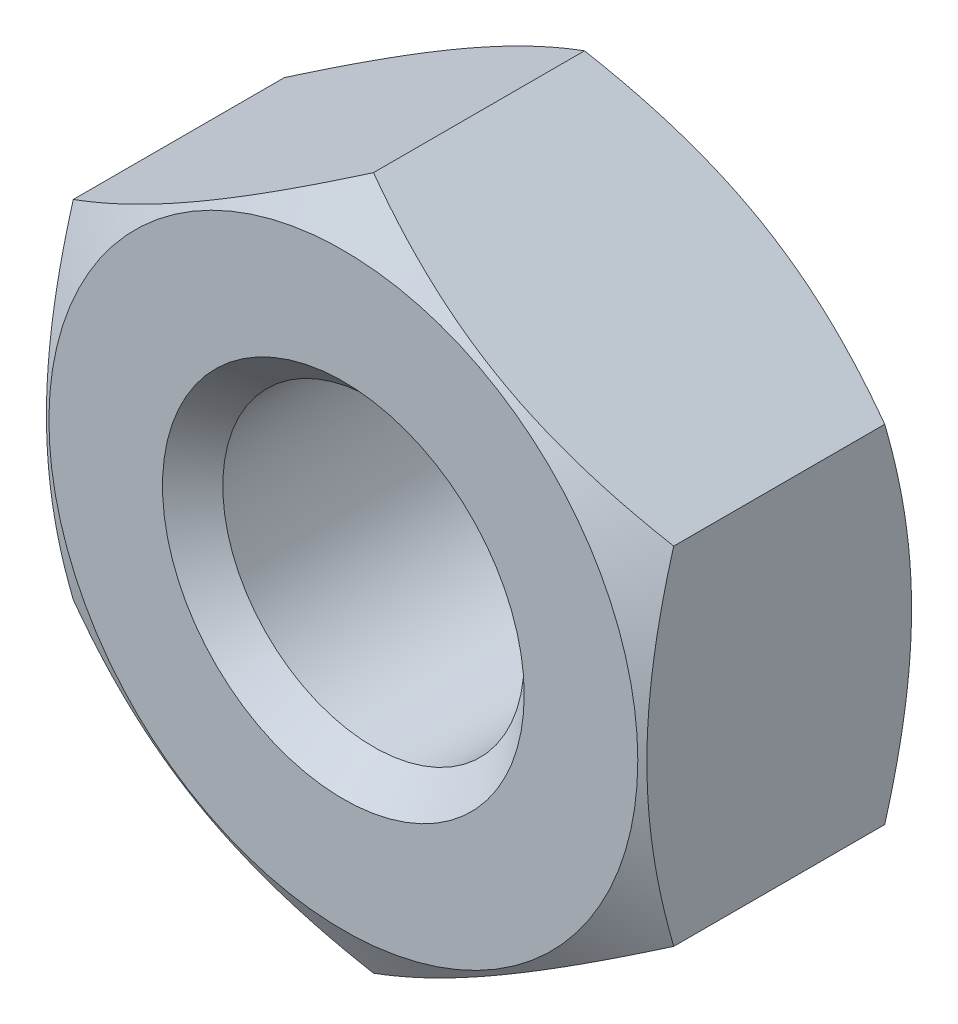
ISO-10303-21;
HEADER;
FILE_DESCRIPTION(('STEP AP214'),'2;1');
FILE_NAME('part.step','',(''),(''),'','','');
FILE_SCHEMA(('AUTOMOTIVE_DESIGN { 1 0 10303 214 1 1 1 1 }'));
ENDSEC;
DATA;
#1=APPLICATION_CONTEXT('core data for automotive mechanical design processes');
#2=APPLICATION_PROTOCOL_DEFINITION('international standard','automotive_design',2000,#1);
#3=PRODUCT_CONTEXT('',#1,'mechanical');
#4=PRODUCT('Part','Part','',(#3));
#5=PRODUCT_RELATED_PRODUCT_CATEGORY('part','',(#4));
#6=PRODUCT_DEFINITION_FORMATION('','',#4);
#7=PRODUCT_DEFINITION_CONTEXT('part definition',#1,'design');
#8=PRODUCT_DEFINITION('design','',#6,#7);
#9=PRODUCT_DEFINITION_SHAPE('','',#8);
#10=(LENGTH_UNIT() NAMED_UNIT(*) SI_UNIT(.MILLI.,.METRE.));
#11=(NAMED_UNIT(*) PLANE_ANGLE_UNIT() SI_UNIT($,.RADIAN.));
#12=(NAMED_UNIT(*) SI_UNIT($,.STERADIAN.) SOLID_ANGLE_UNIT());
#13=UNCERTAINTY_MEASURE_WITH_UNIT(LENGTH_MEASURE(1.E-05),#10,'distance_accuracy_value','');
#14=(GEOMETRIC_REPRESENTATION_CONTEXT(3) GLOBAL_UNCERTAINTY_ASSIGNED_CONTEXT((#13)) GLOBAL_UNIT_ASSIGNED_CONTEXT((#10,
#11,#12)) REPRESENTATION_CONTEXT('',''));
#15=CARTESIAN_POINT('',(0.,0.,0.));
#16=DIRECTION('',(0.,0.,1.));
#17=DIRECTION('',(1.,0.,0.));
#18=AXIS2_PLACEMENT_3D('',#15,#16,#17);
#19=CARTESIAN_POINT('',(0.,0.,0.500000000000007));
#20=DIRECTION('',(0.,0.,1.));
#21=DIRECTION('',(1.,0.,0.));
#22=AXIS2_PLACEMENT_3D('',#19,#20,#21);
#23=CONICAL_SURFACE('',#22,5.75,1.0471975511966);
#24=CARTESIAN_POINT('',(0.,0.,0.));
#25=DIRECTION('',(0.,0.,1.));
#26=DIRECTION('',(1.,0.,0.));
#27=AXIS2_PLACEMENT_3D('',#24,#25,#26);
#28=CIRCLE('',#27,4.88397459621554);
#29=CARTESIAN_POINT('',(4.88397459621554,0.,0.));
#30=VERTEX_POINT('',#29);
#31=EDGE_CURVE('E189',#30,#30,#28,.F.);
#32=ORIENTED_EDGE('',*,*,#31,.F.);
#33=EDGE_LOOP('',(#32));
#34=FACE_BOUND('',#33,.T.);
#35=CARTESIAN_POINT('',(-0.000199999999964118,5.75011547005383,0.500066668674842));
#36=CARTESIAN_POINT('',(0.21864011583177,5.62376807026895,0.427102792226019));
#37=CARTESIAN_POINT('',(0.43935197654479,5.49634001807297,0.360738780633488));
#38=CARTESIAN_POINT('',(0.884597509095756,5.23927738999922,0.244899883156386));
#39=CARTESIAN_POINT('',(1.10913909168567,5.10963824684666,0.195465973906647));
#40=CARTESIAN_POINT('',(1.55547370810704,4.85194683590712,0.118528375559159));
#41=CARTESIAN_POINT('',(1.77719723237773,4.72393469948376,0.0905122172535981));
#42=CARTESIAN_POINT('',(2.11056245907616,4.53146619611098,0.0653894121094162));
#43=CARTESIAN_POINT('',(2.22176024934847,4.46726612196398,0.059830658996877));
#44=CARTESIAN_POINT('',(2.44425859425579,4.33880664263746,0.054441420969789));
#45=CARTESIAN_POINT('',(2.55555914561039,4.27454723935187,0.0546107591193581));
#46=CARTESIAN_POINT('',(2.86049167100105,4.09849436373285,0.0629579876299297));
#47=CARTESIAN_POINT('',(3.05402260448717,3.98675922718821,0.0769768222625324));
#48=CARTESIAN_POINT('',(3.4398000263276,3.76403052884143,0.121430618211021));
#49=CARTESIAN_POINT('',(3.63204515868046,3.65303774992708,0.151880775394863));
#50=CARTESIAN_POINT('',(4.01859983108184,3.42986030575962,0.227998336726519));
#51=CARTESIAN_POINT('',(4.21286058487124,3.31770380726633,0.273988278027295));
#52=CARTESIAN_POINT('',(4.59848496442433,3.09506346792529,0.378367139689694));
#53=CARTESIAN_POINT('',(4.78985352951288,2.98457677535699,0.436731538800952));
#54=CARTESIAN_POINT('',(4.97984607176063,2.87488452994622,0.500066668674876));
#55=B_SPLINE_CURVE_WITH_KNOTS('',3,(#35,#36,#37,#38,#39,#40,#41,#42,#43,#44,#45,#46,#47,#48,#49,
#50,#51,#52,#53,#54),.UNSPECIFIED.,.F.,.F.,(4,2,2,2,2,2,2,2,2,4),(0.,0.789329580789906,
1.5805563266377,2.35220111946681,2.7376510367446,3.12308904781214,3.79411612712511,
4.4657648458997,5.15231066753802,5.83750853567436),.UNSPECIFIED.);
#56=CARTESIAN_POINT('',(0.,5.75000000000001,0.500000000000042));
#57=VERTEX_POINT('',#56);
#58=CARTESIAN_POINT('',(4.97964607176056,2.87500000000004,0.500000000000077));
#59=VERTEX_POINT('',#58);
#60=EDGE_CURVE('E82',#57,#59,#55,.T.);
#61=ORIENTED_EDGE('',*,*,#60,.T.);
#62=CARTESIAN_POINT('',(4.97964607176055,-7.61726504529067,2.43442798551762));
#63=CARTESIAN_POINT('',(4.97964607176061,-7.39868994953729,2.32883225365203));
#64=CARTESIAN_POINT('',(4.97964607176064,-7.17959720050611,2.2242885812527));
#65=CARTESIAN_POINT('',(4.97964607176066,-6.74009646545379,2.01790671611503));
#66=CARTESIAN_POINT('',(4.97964607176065,-6.51968825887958,1.91606899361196));
#67=CARTESIAN_POINT('',(4.97964607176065,-6.07608226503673,1.71516222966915));
#68=CARTESIAN_POINT('',(4.97964607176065,-5.85287572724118,1.61611243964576));
#69=CARTESIAN_POINT('',(4.97964607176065,-5.40462524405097,1.42227834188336));
#70=CARTESIAN_POINT('',(4.97964607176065,-5.1795813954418,1.32749381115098));
#71=CARTESIAN_POINT('',(4.97964607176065,-4.724540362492,1.14221405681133));
#72=CARTESIAN_POINT('',(4.97964607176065,-4.49451620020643,1.05178472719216));
#73=CARTESIAN_POINT('',(4.97964607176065,-4.03175182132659,0.87802766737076));
#74=CARTESIAN_POINT('',(4.97964607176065,-3.79901130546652,0.794700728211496));
#75=CARTESIAN_POINT('',(4.97964607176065,-3.33092535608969,0.637392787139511));
#76=CARTESIAN_POINT('',(4.97964607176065,-3.09558669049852,0.563391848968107));
#77=CARTESIAN_POINT('',(4.97964607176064,-2.62156165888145,0.427145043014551));
#78=CARTESIAN_POINT('',(4.97964607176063,-2.38287637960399,0.364895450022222));
#79=CARTESIAN_POINT('',(4.97964607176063,-1.90200345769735,0.25517429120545));
#80=CARTESIAN_POINT('',(4.97964607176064,-1.65981480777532,0.207707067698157));
#81=CARTESIAN_POINT('',(4.97964607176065,-1.17249224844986,0.130765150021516));
#82=CARTESIAN_POINT('',(4.97964607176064,-0.927358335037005,0.101290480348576));
#83=CARTESIAN_POINT('',(4.97964607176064,-0.559271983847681,0.072462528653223));
#84=CARTESIAN_POINT('',(4.97964607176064,-0.43689092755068,0.0654155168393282));
#85=CARTESIAN_POINT('',(4.97964607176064,-0.191934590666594,0.0565064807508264));
#86=CARTESIAN_POINT('',(4.97964607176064,-0.0693593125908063,0.054644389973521));
#87=CARTESIAN_POINT('',(4.97964607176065,0.175723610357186,0.0561554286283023));
#88=CARTESIAN_POINT('',(4.97964607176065,0.298231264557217,0.0595270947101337));
#89=CARTESIAN_POINT('',(4.97964607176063,0.542998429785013,0.0714204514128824));
#90=CARTESIAN_POINT('',(4.97964607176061,0.665257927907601,0.0799424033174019));
#91=CARTESIAN_POINT('',(4.97964607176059,0.961835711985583,0.106684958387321));
#92=CARTESIAN_POINT('',(4.97964607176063,1.13592376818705,0.127500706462));
#93=CARTESIAN_POINT('',(4.97964607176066,1.48273636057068,0.178414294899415));
#94=CARTESIAN_POINT('',(4.97964607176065,1.65546071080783,0.208513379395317));
#95=CARTESIAN_POINT('',(4.97964607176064,1.99943889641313,0.276929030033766));
#96=CARTESIAN_POINT('',(4.97964607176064,2.17069108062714,0.315253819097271));
#97=CARTESIAN_POINT('',(4.97964607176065,2.51143678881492,0.398952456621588));
#98=CARTESIAN_POINT('',(4.97964607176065,2.68093041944,0.444325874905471));
#99=CARTESIAN_POINT('',(4.97964607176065,3.02231431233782,0.542217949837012));
#100=CARTESIAN_POINT('',(4.97964607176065,3.19416200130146,0.594884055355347));
#101=CARTESIAN_POINT('',(4.97964607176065,3.53604078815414,0.705403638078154));
#102=CARTESIAN_POINT('',(4.97964607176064,3.7060730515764,0.76325353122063));
#103=CARTESIAN_POINT('',(4.97964607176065,4.0436385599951,0.882947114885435));
#104=CARTESIAN_POINT('',(4.97964607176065,4.2111804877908,0.944766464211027));
#105=CARTESIAN_POINT('',(4.97964607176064,4.54496584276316,1.07202306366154));
#106=CARTESIAN_POINT('',(4.97964607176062,4.71120871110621,1.13746178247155));
#107=CARTESIAN_POINT('',(4.97964607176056,4.87684835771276,1.20435179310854));
#108=B_SPLINE_CURVE_WITH_KNOTS('',3,(#62,#63,#64,#65,#66,#67,#68,#69,#70,#71,#72,#73,#74,#75,
#76,#77,#78,#79,#80,#81,#82,#83,#84,#85,#86,#87,#88,#89,#90,#91,#92,#93,#94,#95,#96,#97,#98,#99,
#100,#101,#102,#103,#104,#105,#106,#107),.UNSPECIFIED.,.F.,.F.,(4,2,2,2,2,2,2,2,2,2,2,2,2,2,2,2,
2,2,2,2,2,2,4),(0.,0.728247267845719,1.45662027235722,2.18917485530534,2.92169109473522,
3.66308368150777,4.40455873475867,5.14442082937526,5.88404799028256,6.6238922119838,
7.36373744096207,7.7313954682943,8.09904877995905,8.46659931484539,8.83416849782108,
9.3598597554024,9.88562149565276,10.4119112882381,10.9381689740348,11.4772800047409,
12.0160211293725,12.551726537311,13.0876509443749),.UNSPECIFIED.);
#109=CARTESIAN_POINT('',(4.97964607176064,-2.87499999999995,0.499999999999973));
#110=VERTEX_POINT('',#109);
#111=EDGE_CURVE('E181',#59,#110,#108,.F.);
#112=ORIENTED_EDGE('',*,*,#111,.T.);
#113=CARTESIAN_POINT('',(4.97984607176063,-2.87488452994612,0.500066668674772));
#114=CARTESIAN_POINT('',(4.76100595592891,-3.00123192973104,0.427102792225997));
#115=CARTESIAN_POINT('',(4.54029409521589,-3.12865998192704,0.360738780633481));
#116=CARTESIAN_POINT('',(4.09504856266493,-3.38572261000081,0.244899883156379));
#117=CARTESIAN_POINT('',(3.87050698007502,-3.51536175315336,0.195465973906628));
#118=CARTESIAN_POINT('',(3.42417236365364,-3.77305316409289,0.11852837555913));
#119=CARTESIAN_POINT('',(3.20244883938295,-3.90106530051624,0.0905122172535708));
#120=CARTESIAN_POINT('',(2.86908361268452,-4.09353380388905,0.0653894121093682));
#121=CARTESIAN_POINT('',(2.75788582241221,-4.15773387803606,0.059830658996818));
#122=CARTESIAN_POINT('',(2.53538747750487,-4.28619335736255,0.0544414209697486));
#123=CARTESIAN_POINT('',(2.42408692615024,-4.35045276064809,0.0546107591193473));
#124=CARTESIAN_POINT('',(2.11915440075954,-4.52650563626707,0.062957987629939));
#125=CARTESIAN_POINT('',(1.92562346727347,-4.63824077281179,0.0769768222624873));
#126=CARTESIAN_POINT('',(1.53984604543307,-4.86096947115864,0.121430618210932));
#127=CARTESIAN_POINT('',(1.3476009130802,-4.97196225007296,0.151880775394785));
#128=CARTESIAN_POINT('',(0.961046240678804,-5.19513969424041,0.227998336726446));
#129=CARTESIAN_POINT('',(0.76678548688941,-5.30729619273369,0.273988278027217));
#130=CARTESIAN_POINT('',(0.381161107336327,-5.52993653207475,0.378367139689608));
#131=CARTESIAN_POINT('',(0.189792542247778,-5.64042322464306,0.436731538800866));
#132=CARTESIAN_POINT('',(-0.000199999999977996,-5.75011547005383,0.500066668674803));
#133=B_SPLINE_CURVE_WITH_KNOTS('',3,(#113,#114,#115,#116,#117,#118,#119,#120,#121,#122,#123,
#124,#125,#126,#127,#128,#129,#130,#131,#132),.UNSPECIFIED.,.F.,.F.,(4,2,2,2,2,2,2,2,2,4),(0.,
0.789329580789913,1.58055632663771,2.35220111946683,2.73765103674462,3.12308904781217,
3.79411612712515,4.46576484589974,5.15231066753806,5.8375085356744),.UNSPECIFIED.);
#134=CARTESIAN_POINT('',(0.,-5.74999999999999,0.500000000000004));
#135=VERTEX_POINT('',#134);
#136=EDGE_CURVE('E175',#110,#135,#133,.T.);
#137=ORIENTED_EDGE('',*,*,#136,.T.);
#138=CARTESIAN_POINT('',(0.000200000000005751,-5.75011547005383,0.500066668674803));
#139=CARTESIAN_POINT('',(-0.218640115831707,-5.62376807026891,0.427102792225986));
#140=CARTESIAN_POINT('',(-0.439351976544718,-5.49634001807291,0.360738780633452));
#141=CARTESIAN_POINT('',(-0.884597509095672,-5.23927738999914,0.244899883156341));
#142=CARTESIAN_POINT('',(-1.10913909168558,-5.10963824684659,0.195465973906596));
#143=CARTESIAN_POINT('',(-1.55547370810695,-4.85194683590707,0.118528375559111));
#144=CARTESIAN_POINT('',(-1.77719723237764,-4.72393469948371,0.0905122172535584));
#145=CARTESIAN_POINT('',(-2.11056245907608,-4.53146619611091,0.0653894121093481));
#146=CARTESIAN_POINT('',(-2.22176024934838,-4.46726612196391,0.0598306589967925));
#147=CARTESIAN_POINT('',(-2.44425859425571,-4.3388066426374,0.0544414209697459));
#148=CARTESIAN_POINT('',(-2.55555914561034,-4.27454723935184,0.0546107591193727));
#149=CARTESIAN_POINT('',(-2.86049167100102,-4.09849436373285,0.0629579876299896));
#150=CARTESIAN_POINT('',(-3.05402260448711,-3.98675922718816,0.076976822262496));
#151=CARTESIAN_POINT('',(-3.4398000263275,-3.76403052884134,0.121430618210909));
#152=CARTESIAN_POINT('',(-3.63204515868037,-3.65303774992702,0.151880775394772));
#153=CARTESIAN_POINT('',(-4.01859983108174,-3.42986030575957,0.227998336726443));
#154=CARTESIAN_POINT('',(-4.21286058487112,-3.3177038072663,0.273988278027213));
#155=CARTESIAN_POINT('',(-4.59848496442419,-3.09506346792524,0.378367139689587));
#156=CARTESIAN_POINT('',(-4.78985352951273,-2.98457677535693,0.436731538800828));
#157=CARTESIAN_POINT('',(-4.97984607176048,-2.87488452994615,0.500066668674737));
#158=B_SPLINE_CURVE_WITH_KNOTS('',3,(#138,#139,#140,#141,#142,#143,#144,#145,#146,#147,#148,
#149,#150,#151,#152,#153,#154,#155,#156,#157),.UNSPECIFIED.,.F.,.F.,(4,2,2,2,2,2,2,2,2,4),(0.,
0.789329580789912,1.5805563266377,2.35220111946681,2.7376510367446,3.12308904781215,
3.7941161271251,4.46576484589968,5.15231066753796,5.83750853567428),.UNSPECIFIED.);
#159=CARTESIAN_POINT('',(-4.97964607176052,-2.875,0.499999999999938));
#160=VERTEX_POINT('',#159);
#161=EDGE_CURVE('E103',#135,#160,#158,.T.);
#162=ORIENTED_EDGE('',*,*,#161,.T.);
#163=CARTESIAN_POINT('',(-4.97964607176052,-7.61726504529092,2.43442798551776));
#164=CARTESIAN_POINT('',(-4.97964607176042,-7.39868994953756,2.32883225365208));
#165=CARTESIAN_POINT('',(-4.97964607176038,-7.17959720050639,2.22428858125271));
#166=CARTESIAN_POINT('',(-4.97964607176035,-6.74009646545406,2.017906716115));
#167=CARTESIAN_POINT('',(-4.97964607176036,-6.51968825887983,1.91606899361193));
#168=CARTESIAN_POINT('',(-4.97964607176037,-6.07608226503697,1.71516222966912));
#169=CARTESIAN_POINT('',(-4.97964607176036,-5.85287572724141,1.61611243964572));
#170=CARTESIAN_POINT('',(-4.97964607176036,-5.40462524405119,1.4222783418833));
#171=CARTESIAN_POINT('',(-4.97964607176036,-5.17958139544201,1.32749381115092));
#172=CARTESIAN_POINT('',(-4.97964607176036,-4.72454036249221,1.14221405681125));
#173=CARTESIAN_POINT('',(-4.97964607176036,-4.49451620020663,1.05178472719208));
#174=CARTESIAN_POINT('',(-4.97964607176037,-4.03175182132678,0.878027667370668));
#175=CARTESIAN_POINT('',(-4.97964607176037,-3.7990113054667,0.794700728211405));
#176=CARTESIAN_POINT('',(-4.97964607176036,-3.33092535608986,0.637392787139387));
#177=CARTESIAN_POINT('',(-4.97964607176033,-3.09558669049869,0.563391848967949));
#178=CARTESIAN_POINT('',(-4.9796460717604,-2.62156165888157,0.427145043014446));
#179=CARTESIAN_POINT('',(-4.97964607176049,-2.38287637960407,0.364895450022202));
#180=CARTESIAN_POINT('',(-4.97964607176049,-1.9020034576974,0.255174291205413));
#181=CARTESIAN_POINT('',(-4.9796460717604,-1.65981480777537,0.207707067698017));
#182=CARTESIAN_POINT('',(-4.97964607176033,-1.1724922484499,0.130765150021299));
#183=CARTESIAN_POINT('',(-4.97964607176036,-0.92735833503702,0.101290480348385));
#184=CARTESIAN_POINT('',(-4.97964607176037,-0.559271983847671,0.0724625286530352));
#185=CARTESIAN_POINT('',(-4.97964607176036,-0.436890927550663,0.0654155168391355));
#186=CARTESIAN_POINT('',(-4.97964607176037,-0.191934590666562,0.0565064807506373));
#187=CARTESIAN_POINT('',(-4.97964607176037,-0.0693593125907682,0.0546443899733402));
#188=CARTESIAN_POINT('',(-4.97964607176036,0.175723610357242,0.0561554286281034));
#189=CARTESIAN_POINT('',(-4.97964607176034,0.298231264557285,0.0595270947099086));
#190=CARTESIAN_POINT('',(-4.97964607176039,0.542998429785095,0.0714204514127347));
#191=CARTESIAN_POINT('',(-4.97964607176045,0.665257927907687,0.0799424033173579));
#192=CARTESIAN_POINT('',(-4.97964607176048,0.961835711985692,0.106684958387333));
#193=CARTESIAN_POINT('',(-4.9796460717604,1.13592376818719,0.12750070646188));
#194=CARTESIAN_POINT('',(-4.97964607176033,1.48273636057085,0.178414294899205));
#195=CARTESIAN_POINT('',(-4.97964607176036,1.655460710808,0.208513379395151));
#196=CARTESIAN_POINT('',(-4.97964607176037,1.9994388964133,0.276929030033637));
#197=CARTESIAN_POINT('',(-4.97964607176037,2.17069108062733,0.315253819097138));
#198=CARTESIAN_POINT('',(-4.97964607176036,2.51143678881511,0.398952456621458));
#199=CARTESIAN_POINT('',(-4.97964607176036,2.68093041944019,0.444325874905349));
#200=CARTESIAN_POINT('',(-4.97964607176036,3.02231431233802,0.542217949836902));
#201=CARTESIAN_POINT('',(-4.97964607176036,3.19416200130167,0.59488405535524));
#202=CARTESIAN_POINT('',(-4.97964607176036,3.53604078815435,0.705403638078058));
#203=CARTESIAN_POINT('',(-4.97964607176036,3.70607305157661,0.76325353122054));
#204=CARTESIAN_POINT('',(-4.97964607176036,4.04363855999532,0.882947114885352));
#205=CARTESIAN_POINT('',(-4.97964607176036,4.21118048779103,0.944766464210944));
#206=CARTESIAN_POINT('',(-4.97964607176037,4.5449658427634,1.07202306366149));
#207=CARTESIAN_POINT('',(-4.97964607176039,4.71120871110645,1.13746178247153));
#208=CARTESIAN_POINT('',(-4.97964607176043,4.87684835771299,1.2043517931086));
#209=B_SPLINE_CURVE_WITH_KNOTS('',3,(#163,#164,#165,#166,#167,#168,#169,#170,#171,#172,#173,
#174,#175,#176,#177,#178,#179,#180,#181,#182,#183,#184,#185,#186,#187,#188,#189,#190,#191,#192,
#193,#194,#195,#196,#197,#198,#199,#200,#201,#202,#203,#204,#205,#206,#207,#208),.UNSPECIFIED.,
.F.,.F.,(4,2,2,2,2,2,2,2,2,2,2,2,2,2,2,2,2,2,2,2,2,2,4),(0.,0.728247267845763,1.4566202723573,
2.18917485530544,2.92169109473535,3.66308368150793,4.40455873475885,5.14442082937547,
5.88404799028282,6.62389221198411,7.36373744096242,7.73139546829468,8.09904877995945,
8.46659931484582,8.83416849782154,9.3598597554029,9.88562149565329,10.4119112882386,
10.9381689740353,11.4772800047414,12.0160211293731,12.5517265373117,13.0876509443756),.UNSPECIFIED.);
#210=CARTESIAN_POINT('',(-4.97964607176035,2.875,0.500000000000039));
#211=VERTEX_POINT('',#210);
#212=EDGE_CURVE('E101',#160,#211,#209,.T.);
#213=ORIENTED_EDGE('',*,*,#212,.T.);
#214=CARTESIAN_POINT('',(-4.97984607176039,2.87488452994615,0.500066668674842));
#215=CARTESIAN_POINT('',(-4.76100595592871,3.00123192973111,0.427102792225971));
#216=CARTESIAN_POINT('',(-4.54029409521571,3.12865998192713,0.360738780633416));
#217=CARTESIAN_POINT('',(-4.09504856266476,3.38572261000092,0.244899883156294));
#218=CARTESIAN_POINT('',(-3.87050698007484,3.51536175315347,0.195465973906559));
#219=CARTESIAN_POINT('',(-3.42417236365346,3.77305316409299,0.118528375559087));
#220=CARTESIAN_POINT('',(-3.20244883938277,3.90106530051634,0.0905122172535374));
#221=CARTESIAN_POINT('',(-2.86908361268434,4.09353380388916,0.0653894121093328));
#222=CARTESIAN_POINT('',(-2.75788582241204,4.15773387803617,0.0598306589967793));
#223=CARTESIAN_POINT('',(-2.53538747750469,4.28619335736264,0.0544414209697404));
#224=CARTESIAN_POINT('',(-2.42408692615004,4.35045276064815,0.0546107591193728));
#225=CARTESIAN_POINT('',(-2.11915440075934,4.5265056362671,0.0629579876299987));
#226=CARTESIAN_POINT('',(-1.9256234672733,4.63824077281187,0.0769768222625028));
#227=CARTESIAN_POINT('',(-1.53984604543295,4.86096947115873,0.12143061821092));
#228=CARTESIAN_POINT('',(-1.34760091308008,4.97196225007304,0.151880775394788));
#229=CARTESIAN_POINT('',(-0.961046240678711,5.19513969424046,0.22799833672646));
#230=CARTESIAN_POINT('',(-0.766785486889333,5.30729619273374,0.273988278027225));
#231=CARTESIAN_POINT('',(-0.381161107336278,5.52993653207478,0.378367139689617));
#232=CARTESIAN_POINT('',(-0.189792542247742,5.64042322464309,0.43673153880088));
#233=CARTESIAN_POINT('',(0.000200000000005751,5.75011547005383,0.500066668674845));
#234=B_SPLINE_CURVE_WITH_KNOTS('',3,(#214,#215,#216,#217,#218,#219,#220,#221,#222,#223,#224,
#225,#226,#227,#228,#229,#230,#231,#232,#233),.UNSPECIFIED.,.F.,.F.,(4,2,2,2,2,2,2,2,2,4),(0.,
0.789329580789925,1.58055632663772,2.35220111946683,2.73765103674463,3.12308904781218,
3.79411612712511,4.46576484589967,5.15231066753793,5.83750853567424),.UNSPECIFIED.);
#235=EDGE_CURVE('E87',#211,#57,#234,.T.);
#236=ORIENTED_EDGE('',*,*,#235,.T.);
#237=EDGE_LOOP('',(#61,#112,#137,#162,#213,#236));
#238=FACE_BOUND('',#237,.T.);
#239=ADVANCED_FACE('F27',(#34,#238),#23,.T.);
#240=CARTESIAN_POINT('',(0.,0.,4.5));
#241=DIRECTION('',(0.,0.,-1.));
#242=DIRECTION('',(-1.,0.,0.));
#243=AXIS2_PLACEMENT_3D('',#240,#241,#242);
#244=CONICAL_SURFACE('',#243,4.88397459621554,1.0471975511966);
#245=CARTESIAN_POINT('',(0.,0.,4.5));
#246=DIRECTION('',(0.,0.,1.));
#247=DIRECTION('',(1.,0.,0.));
#248=AXIS2_PLACEMENT_3D('',#245,#246,#247);
#249=CIRCLE('',#248,4.88397459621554);
#250=CARTESIAN_POINT('',(4.88397459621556,0.,4.49999999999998));
#251=VERTEX_POINT('',#250);
#252=EDGE_CURVE('E212',#251,#251,#249,.T.);
#253=ORIENTED_EDGE('',*,*,#252,.F.);
#254=EDGE_LOOP('',(#253));
#255=FACE_BOUND('',#254,.T.);
#256=CARTESIAN_POINT('',(-0.000199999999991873,-5.75011547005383,3.9999333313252));
#257=CARTESIAN_POINT('',(0.218640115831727,-5.6237680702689,4.07289720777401));
#258=CARTESIAN_POINT('',(0.439351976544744,-5.4963400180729,4.13926121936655));
#259=CARTESIAN_POINT('',(0.884597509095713,-5.23927738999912,4.25510011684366));
#260=CARTESIAN_POINT('',(1.10913909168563,-5.10963824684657,4.3045340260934));
#261=CARTESIAN_POINT('',(1.55547370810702,-4.85194683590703,4.38147162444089));
#262=CARTESIAN_POINT('',(1.77719723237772,-4.72393469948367,4.40948778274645));
#263=CARTESIAN_POINT('',(2.11056245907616,-4.53146619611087,4.43461058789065));
#264=CARTESIAN_POINT('',(2.22176024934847,-4.46726612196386,4.4401693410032));
#265=CARTESIAN_POINT('',(2.44425859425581,-4.33880664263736,4.44555857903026));
#266=CARTESIAN_POINT('',(2.55555914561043,-4.2745472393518,4.44538924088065));
#267=CARTESIAN_POINT('',(2.86049167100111,-4.09849436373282,4.43704201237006));
#268=CARTESIAN_POINT('',(3.05402260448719,-3.98675922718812,4.42302317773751));
#269=CARTESIAN_POINT('',(3.43980002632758,-3.7640305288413,4.37856938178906));
#270=CARTESIAN_POINT('',(3.63204515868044,-3.65303774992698,4.34811922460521));
#271=CARTESIAN_POINT('',(4.01859983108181,-3.42986030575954,4.27200166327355));
#272=CARTESIAN_POINT('',(4.2128605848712,-3.31770380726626,4.22601172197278));
#273=CARTESIAN_POINT('',(4.59848496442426,-3.09506346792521,4.12163286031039));
#274=CARTESIAN_POINT('',(4.7898535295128,-2.98457677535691,4.06326846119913));
#275=CARTESIAN_POINT('',(4.97984607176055,-2.87488452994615,3.99993333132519));
#276=B_SPLINE_CURVE_WITH_KNOTS('',3,(#256,#257,#258,#259,#260,#261,#262,#263,#264,#265,#266,
#267,#268,#269,#270,#271,#272,#273,#274,#275),.UNSPECIFIED.,.F.,.F.,(4,2,2,2,2,2,2,2,2,4),(0.,
0.789329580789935,1.58055632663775,2.35220111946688,2.73765103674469,3.12308904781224,
3.79411612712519,4.46576484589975,5.15231066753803,5.83750853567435),.UNSPECIFIED.);
#277=CARTESIAN_POINT('',(0.,-5.74999999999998,4.));
#278=VERTEX_POINT('',#277);
#279=CARTESIAN_POINT('',(4.97964607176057,-2.87499999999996,3.99999999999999));
#280=VERTEX_POINT('',#279);
#281=EDGE_CURVE('E40',#278,#280,#276,.T.);
#282=ORIENTED_EDGE('',*,*,#281,.T.);
#283=CARTESIAN_POINT('',(4.97964607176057,-7.61726504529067,2.06557201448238));
#284=CARTESIAN_POINT('',(4.97964607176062,-7.3986899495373,2.17116774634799));
#285=CARTESIAN_POINT('',(4.97964607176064,-7.17959720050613,2.27571141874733));
#286=CARTESIAN_POINT('',(4.97964607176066,-6.74009646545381,2.48209328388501));
#287=CARTESIAN_POINT('',(4.97964607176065,-6.51968825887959,2.58393100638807));
#288=CARTESIAN_POINT('',(4.97964607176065,-6.07608226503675,2.78483777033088));
#289=CARTESIAN_POINT('',(4.97964607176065,-5.8528757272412,2.88388756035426));
#290=CARTESIAN_POINT('',(4.97964607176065,-5.404625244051,3.07772165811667));
#291=CARTESIAN_POINT('',(4.97964607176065,-5.17958139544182,3.17250618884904));
#292=CARTESIAN_POINT('',(4.97964607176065,-4.72454036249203,3.3577859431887));
#293=CARTESIAN_POINT('',(4.97964607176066,-4.49451620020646,3.44821527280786));
#294=CARTESIAN_POINT('',(4.97964607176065,-4.03175182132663,3.62197233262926));
#295=CARTESIAN_POINT('',(4.97964607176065,-3.79901130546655,3.70529927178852));
#296=CARTESIAN_POINT('',(4.97964607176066,-3.33092535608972,3.86260721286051));
#297=CARTESIAN_POINT('',(4.97964607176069,-3.09558669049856,3.93660815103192));
#298=CARTESIAN_POINT('',(4.97964607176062,-2.62156165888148,4.07285495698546));
#299=CARTESIAN_POINT('',(4.97964607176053,-2.38287637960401,4.13510454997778));
#300=CARTESIAN_POINT('',(4.97964607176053,-1.90200345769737,4.24482570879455));
#301=CARTESIAN_POINT('',(4.97964607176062,-1.65981480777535,4.29229293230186));
#302=CARTESIAN_POINT('',(4.97964607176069,-1.1724922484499,4.36923484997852));
#303=CARTESIAN_POINT('',(4.97964607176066,-0.927358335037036,4.39870951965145));
#304=CARTESIAN_POINT('',(4.97964607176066,-0.55927198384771,4.42753747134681));
#305=CARTESIAN_POINT('',(4.97964607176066,-0.43689092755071,4.4345844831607));
#306=CARTESIAN_POINT('',(4.97964607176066,-0.191934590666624,4.4434935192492));
#307=CARTESIAN_POINT('',(4.97964607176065,-0.0693593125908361,4.44535561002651));
#308=CARTESIAN_POINT('',(4.97964607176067,0.175723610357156,4.44384457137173));
#309=CARTESIAN_POINT('',(4.97964607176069,0.298231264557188,4.4404729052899));
#310=CARTESIAN_POINT('',(4.97964607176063,0.542998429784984,4.42857954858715));
#311=CARTESIAN_POINT('',(4.97964607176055,0.665257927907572,4.42005759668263));
#312=CARTESIAN_POINT('',(4.97964607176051,0.961835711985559,4.39331504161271));
#313=CARTESIAN_POINT('',(4.97964607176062,1.13592376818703,4.37249929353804));
#314=CARTESIAN_POINT('',(4.9796460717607,1.48273636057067,4.32158570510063));
#315=CARTESIAN_POINT('',(4.97964607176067,1.65546071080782,4.29148662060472));
#316=CARTESIAN_POINT('',(4.97964607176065,1.99943889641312,4.22307096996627));
#317=CARTESIAN_POINT('',(4.97964607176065,2.17069108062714,4.18474618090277));
#318=CARTESIAN_POINT('',(4.97964607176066,2.51143678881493,4.10104754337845));
#319=CARTESIAN_POINT('',(4.97964607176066,2.68093041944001,4.05567412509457));
#320=CARTESIAN_POINT('',(4.97964607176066,3.02231431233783,3.95778205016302));
#321=CARTESIAN_POINT('',(4.97964607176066,3.19416200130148,3.90511594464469));
#322=CARTESIAN_POINT('',(4.97964607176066,3.53604078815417,3.79459636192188));
#323=CARTESIAN_POINT('',(4.97964607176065,3.70607305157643,3.7367464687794));
#324=CARTESIAN_POINT('',(4.97964607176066,4.04363855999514,3.61705288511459));
#325=CARTESIAN_POINT('',(4.97964607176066,4.21118048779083,3.555233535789));
#326=CARTESIAN_POINT('',(4.97964607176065,4.54496584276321,3.42797693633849));
#327=CARTESIAN_POINT('',(4.97964607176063,4.71120871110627,3.36253821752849));
#328=CARTESIAN_POINT('',(4.97964607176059,4.87684835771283,3.29564820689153));
#329=B_SPLINE_CURVE_WITH_KNOTS('',3,(#283,#284,#285,#286,#287,#288,#289,#290,#291,#292,#293,
#294,#295,#296,#297,#298,#299,#300,#301,#302,#303,#304,#305,#306,#307,#308,#309,#310,#311,#312,
#313,#314,#315,#316,#317,#318,#319,#320,#321,#322,#323,#324,#325,#326,#327,#328),.UNSPECIFIED.,
.F.,.F.,(4,2,2,2,2,2,2,2,2,2,2,2,2,2,2,2,2,2,2,2,2,2,4),(0.,0.728247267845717,1.45662027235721,
2.18917485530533,2.92169109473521,3.66308368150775,4.40455873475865,5.14442082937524,
5.88404799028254,6.62389221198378,7.36373744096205,7.73139546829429,8.09904877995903,
8.46659931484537,8.83416849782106,9.35985975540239,9.88562149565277,10.4119112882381,
10.9381689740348,11.4772800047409,12.0160211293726,12.5517265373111,13.087650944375),.UNSPECIFIED.);
#330=CARTESIAN_POINT('',(4.97964607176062,2.87500000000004,3.99999999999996));
#331=VERTEX_POINT('',#330);
#332=EDGE_CURVE('E11',#280,#331,#329,.T.);
#333=ORIENTED_EDGE('',*,*,#332,.T.);
#334=CARTESIAN_POINT('',(4.97984607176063,2.87488452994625,3.99993333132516));
#335=CARTESIAN_POINT('',(4.76100595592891,3.00123192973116,4.07289720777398));
#336=CARTESIAN_POINT('',(4.5402940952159,3.12865998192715,4.13926121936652));
#337=CARTESIAN_POINT('',(4.09504856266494,3.38572261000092,4.25510011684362));
#338=CARTESIAN_POINT('',(3.87050698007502,3.51536175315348,4.30453402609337));
#339=CARTESIAN_POINT('',(3.42417236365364,3.77305316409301,4.38147162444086));
#340=CARTESIAN_POINT('',(3.20244883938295,3.90106530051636,4.40948778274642));
#341=CARTESIAN_POINT('',(2.86908361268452,4.09353380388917,4.43461058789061));
#342=CARTESIAN_POINT('',(2.75788582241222,4.15773387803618,4.44016934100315));
#343=CARTESIAN_POINT('',(2.53538747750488,4.28619335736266,4.44555857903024));
#344=CARTESIAN_POINT('',(2.42408692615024,4.35045276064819,4.44538924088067));
#345=CARTESIAN_POINT('',(2.11915440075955,4.52650563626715,4.43704201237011));
#346=CARTESIAN_POINT('',(1.92562346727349,4.63824077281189,4.4230231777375));
#347=CARTESIAN_POINT('',(1.53984604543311,4.86096947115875,4.37856938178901));
#348=CARTESIAN_POINT('',(1.34760091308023,4.97196225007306,4.34811922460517));
#349=CARTESIAN_POINT('',(0.961046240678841,5.19513969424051,4.27200166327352));
#350=CARTESIAN_POINT('',(0.766785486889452,5.3072961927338,4.22601172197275));
#351=CARTESIAN_POINT('',(0.381161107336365,5.52993653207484,4.12163286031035));
#352=CARTESIAN_POINT('',(0.189792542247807,5.64042322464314,4.0632684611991));
#353=CARTESIAN_POINT('',(-0.000199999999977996,5.75011547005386,3.99993333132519));
#354=B_SPLINE_CURVE_WITH_KNOTS('',3,(#334,#335,#336,#337,#338,#339,#340,#341,#342,#343,#344,
#345,#346,#347,#348,#349,#350,#351,#352,#353),.UNSPECIFIED.,.F.,.F.,(4,2,2,2,2,2,2,2,2,4),(0.,
0.789329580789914,1.58055632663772,2.35220111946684,2.73765103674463,3.12308904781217,
3.79411612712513,4.46576484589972,5.15231066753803,5.83750853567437),.UNSPECIFIED.);
#355=CARTESIAN_POINT('',(0.,5.75000000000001,3.99999999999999));
#356=VERTEX_POINT('',#355);
#357=EDGE_CURVE('E136',#331,#356,#354,.T.);
#358=ORIENTED_EDGE('',*,*,#357,.T.);
#359=CARTESIAN_POINT('',(0.000200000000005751,5.75011547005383,3.99993333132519));
#360=CARTESIAN_POINT('',(-0.218640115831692,5.62376807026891,4.07289720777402));
#361=CARTESIAN_POINT('',(-0.439351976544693,5.49634001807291,4.13926121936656));
#362=CARTESIAN_POINT('',(-0.884597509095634,5.23927738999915,4.25510011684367));
#363=CARTESIAN_POINT('',(-1.10913909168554,5.10963824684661,4.30453402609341));
#364=CARTESIAN_POINT('',(-1.5554737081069,4.85194683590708,4.38147162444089));
#365=CARTESIAN_POINT('',(-1.77719723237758,4.72393469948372,4.40948778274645));
#366=CARTESIAN_POINT('',(-2.11056245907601,4.53146619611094,4.43461058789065));
#367=CARTESIAN_POINT('',(-2.22176024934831,4.46726612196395,4.44016934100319));
#368=CARTESIAN_POINT('',(-2.44425859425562,4.33880664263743,4.44555857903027));
#369=CARTESIAN_POINT('',(-2.55555914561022,4.27454723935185,4.44538924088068));
#370=CARTESIAN_POINT('',(-2.86049167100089,4.09849436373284,4.4370420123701));
#371=CARTESIAN_POINT('',(-3.05402260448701,3.98675922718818,4.42302317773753));
#372=CARTESIAN_POINT('',(-3.43980002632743,3.76403052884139,4.37856938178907));
#373=CARTESIAN_POINT('',(-3.6320451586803,3.65303774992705,4.34811922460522));
#374=CARTESIAN_POINT('',(-4.01859983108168,3.42986030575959,4.27200166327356));
#375=CARTESIAN_POINT('',(-4.21286058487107,3.31770380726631,4.22601172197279));
#376=CARTESIAN_POINT('',(-4.59848496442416,3.09506346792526,4.1216328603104));
#377=CARTESIAN_POINT('',(-4.78985352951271,2.98457677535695,4.06326846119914));
#378=CARTESIAN_POINT('',(-4.97984607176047,2.87488452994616,3.99993333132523));
#379=B_SPLINE_CURVE_WITH_KNOTS('',3,(#359,#360,#361,#362,#363,#364,#365,#366,#367,#368,#369,
#370,#371,#372,#373,#374,#375,#376,#377,#378),.UNSPECIFIED.,.F.,.F.,(4,2,2,2,2,2,2,2,2,4),(0.,
0.789329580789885,1.58055632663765,2.35220111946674,2.73765103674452,3.12308904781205,
3.79411612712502,4.46576484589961,5.15231066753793,5.83750853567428),.UNSPECIFIED.);
#380=CARTESIAN_POINT('',(-4.97964607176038,2.875,4.00000000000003));
#381=VERTEX_POINT('',#380);
#382=EDGE_CURVE('E95',#356,#381,#379,.T.);
#383=ORIENTED_EDGE('',*,*,#382,.T.);
#384=CARTESIAN_POINT('',(-4.97964607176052,-7.61726504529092,2.06557201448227));
#385=CARTESIAN_POINT('',(-4.97964607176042,-7.39868994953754,2.17116774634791));
#386=CARTESIAN_POINT('',(-4.97964607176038,-7.17959720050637,2.27571141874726));
#387=CARTESIAN_POINT('',(-4.97964607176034,-6.74009646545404,2.48209328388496));
#388=CARTESIAN_POINT('',(-4.97964607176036,-6.51968825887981,2.58393100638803));
#389=CARTESIAN_POINT('',(-4.97964607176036,-6.07608226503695,2.78483777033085));
#390=CARTESIAN_POINT('',(-4.97964607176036,-5.85287572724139,2.88388756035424));
#391=CARTESIAN_POINT('',(-4.97964607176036,-5.40462524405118,3.07772165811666));
#392=CARTESIAN_POINT('',(-4.97964607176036,-5.179581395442,3.17250618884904));
#393=CARTESIAN_POINT('',(-4.97964607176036,-4.7245403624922,3.35778594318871));
#394=CARTESIAN_POINT('',(-4.97964607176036,-4.49451620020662,3.44821527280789));
#395=CARTESIAN_POINT('',(-4.97964607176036,-4.03175182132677,3.6219723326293));
#396=CARTESIAN_POINT('',(-4.97964607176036,-3.79901130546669,3.70529927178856));
#397=CARTESIAN_POINT('',(-4.97964607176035,-3.33092535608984,3.86260721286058));
#398=CARTESIAN_POINT('',(-4.97964607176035,-3.09558669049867,3.93660815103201));
#399=CARTESIAN_POINT('',(-4.97964607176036,-2.62156165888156,4.07285495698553));
#400=CARTESIAN_POINT('',(-4.97964607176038,-2.38287637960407,4.1351045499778));
#401=CARTESIAN_POINT('',(-4.97964607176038,-1.9020034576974,4.24482570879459));
#402=CARTESIAN_POINT('',(-4.97964607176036,-1.65981480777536,4.29229293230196));
#403=CARTESIAN_POINT('',(-4.97964607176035,-1.17249224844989,4.36923484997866));
#404=CARTESIAN_POINT('',(-4.97964607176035,-0.927358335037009,4.39870951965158));
#405=CARTESIAN_POINT('',(-4.97964607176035,-0.559271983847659,4.42753747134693));
#406=CARTESIAN_POINT('',(-4.97964607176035,-0.436890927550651,4.43458448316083));
#407=CARTESIAN_POINT('',(-4.97964607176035,-0.191934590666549,4.44349351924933));
#408=CARTESIAN_POINT('',(-4.97964607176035,-0.0693593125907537,4.44535561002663));
#409=CARTESIAN_POINT('',(-4.97964607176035,0.175723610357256,4.44384457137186));
#410=CARTESIAN_POINT('',(-4.97964607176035,0.298231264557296,4.44047290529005));
#411=CARTESIAN_POINT('',(-4.97964607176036,0.542998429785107,4.42857954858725));
#412=CARTESIAN_POINT('',(-4.97964607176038,0.665257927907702,4.42005759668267));
#413=CARTESIAN_POINT('',(-4.97964607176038,0.961835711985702,4.39331504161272));
#414=CARTESIAN_POINT('',(-4.97964607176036,1.13592376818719,4.37249929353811));
#415=CARTESIAN_POINT('',(-4.97964607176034,1.48273636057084,4.32158570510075));
#416=CARTESIAN_POINT('',(-4.97964607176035,1.65546071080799,4.29148662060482));
#417=CARTESIAN_POINT('',(-4.97964607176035,1.99943889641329,4.22307096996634));
#418=CARTESIAN_POINT('',(-4.97964607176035,2.17069108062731,4.18474618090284));
#419=CARTESIAN_POINT('',(-4.97964607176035,2.5114367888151,4.10104754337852));
#420=CARTESIAN_POINT('',(-4.97964607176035,2.68093041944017,4.05567412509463));
#421=CARTESIAN_POINT('',(-4.97964607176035,3.022314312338,3.95778205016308));
#422=CARTESIAN_POINT('',(-4.97964607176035,3.19416200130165,3.90511594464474));
#423=CARTESIAN_POINT('',(-4.97964607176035,3.53604078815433,3.79459636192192));
#424=CARTESIAN_POINT('',(-4.97964607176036,3.70607305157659,3.73674646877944));
#425=CARTESIAN_POINT('',(-4.97964607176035,4.0436385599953,3.61705288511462));
#426=CARTESIAN_POINT('',(-4.97964607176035,4.21118048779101,3.55523353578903));
#427=CARTESIAN_POINT('',(-4.97964607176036,4.54496584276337,3.4279769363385));
#428=CARTESIAN_POINT('',(-4.97964607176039,4.71120871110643,3.36253821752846));
#429=CARTESIAN_POINT('',(-4.97964607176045,4.87684835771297,3.29564820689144));
#430=B_SPLINE_CURVE_WITH_KNOTS('',3,(#384,#385,#386,#387,#388,#389,#390,#391,#392,#393,#394,
#395,#396,#397,#398,#399,#400,#401,#402,#403,#404,#405,#406,#407,#408,#409,#410,#411,#412,#413,
#414,#415,#416,#417,#418,#419,#420,#421,#422,#423,#424,#425,#426,#427,#428,#429),.UNSPECIFIED.,
.F.,.F.,(4,2,2,2,2,2,2,2,2,2,2,2,2,2,2,2,2,2,2,2,2,2,4),(0.,0.728247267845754,1.45662027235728,
2.18917485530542,2.92169109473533,3.6630836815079,4.40455873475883,5.14442082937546,
5.88404799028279,6.62389221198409,7.3637374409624,7.73139546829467,8.09904877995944,
8.4665993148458,8.83416849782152,9.35985975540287,9.88562149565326,10.4119112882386,
10.9381689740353,11.4772800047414,12.0160211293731,12.5517265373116,13.0876509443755),.UNSPECIFIED.);
#431=CARTESIAN_POINT('',(-4.97964607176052,-2.875,4.00000000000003));
#432=VERTEX_POINT('',#431);
#433=EDGE_CURVE('E135',#381,#432,#430,.F.);
#434=ORIENTED_EDGE('',*,*,#433,.T.);
#435=CARTESIAN_POINT('',(-4.9798460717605,-2.87488452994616,3.99993333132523));
#436=CARTESIAN_POINT('',(-4.76100595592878,-3.0012319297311,4.07289720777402));
#437=CARTESIAN_POINT('',(-4.54029409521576,-3.12865998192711,4.13926121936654));
#438=CARTESIAN_POINT('',(-4.09504856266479,-3.38572261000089,4.25510011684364));
#439=CARTESIAN_POINT('',(-3.87050698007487,-3.51536175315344,4.30453402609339));
#440=CARTESIAN_POINT('',(-3.42417236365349,-3.77305316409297,4.38147162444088));
#441=CARTESIAN_POINT('',(-3.20244883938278,-3.90106530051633,4.40948778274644));
#442=CARTESIAN_POINT('',(-2.86908361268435,-4.09353380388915,4.43461058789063));
#443=CARTESIAN_POINT('',(-2.75788582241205,-4.15773387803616,4.44016934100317));
#444=CARTESIAN_POINT('',(-2.5353874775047,-4.28619335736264,4.44555857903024));
#445=CARTESIAN_POINT('',(-2.42408692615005,-4.35045276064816,4.44538924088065));
#446=CARTESIAN_POINT('',(-2.11915440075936,-4.52650563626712,4.43704201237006));
#447=CARTESIAN_POINT('',(-1.92562346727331,-4.63824077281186,4.42302317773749));
#448=CARTESIAN_POINT('',(-1.53984604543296,-4.86096947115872,4.37856938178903));
#449=CARTESIAN_POINT('',(-1.34760091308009,-4.97196225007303,4.34811922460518));
#450=CARTESIAN_POINT('',(-0.961046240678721,-5.19513969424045,4.27200166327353));
#451=CARTESIAN_POINT('',(-0.766785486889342,-5.30729619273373,4.22601172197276));
#452=CARTESIAN_POINT('',(-0.381161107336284,-5.52993653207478,4.12163286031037));
#453=CARTESIAN_POINT('',(-0.189792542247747,-5.64042322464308,4.06326846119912));
#454=CARTESIAN_POINT('',(0.000200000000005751,-5.75011547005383,3.9999333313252));
#455=B_SPLINE_CURVE_WITH_KNOTS('',3,(#435,#436,#437,#438,#439,#440,#441,#442,#443,#444,#445,
#446,#447,#448,#449,#450,#451,#452,#453,#454),.UNSPECIFIED.,.F.,.F.,(4,2,2,2,2,2,2,2,2,4),(0.,
0.789329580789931,1.58055632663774,2.35220111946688,2.73765103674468,3.12308904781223,
3.79411612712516,4.46576484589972,5.15231066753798,5.83750853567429),.UNSPECIFIED.);
#456=EDGE_CURVE('E157',#432,#278,#455,.T.);
#457=ORIENTED_EDGE('',*,*,#456,.T.);
#458=EDGE_LOOP('',(#282,#333,#358,#383,#434,#457));
#459=FACE_BOUND('',#458,.T.);
#460=ADVANCED_FACE('F145',(#255,#459),#244,.T.);
#461=CARTESIAN_POINT('',(0.,0.,4.5));
#462=DIRECTION('',(0.,0.,1.));
#463=DIRECTION('',(1.,0.,0.));
#464=AXIS2_PLACEMENT_3D('',#461,#462,#463);
#465=PLANE('',#464);
#466=CARTESIAN_POINT('',(0.,0.,4.5));
#467=DIRECTION('',(0.,0.,1.));
#468=DIRECTION('',(1.,0.,0.));
#469=AXIS2_PLACEMENT_3D('',#466,#467,#468);
#470=CIRCLE('',#469,3.);
#471=CARTESIAN_POINT('',(3.00000000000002,0.,4.49999999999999));
#472=VERTEX_POINT('',#471);
#473=EDGE_CURVE('E225',#472,#472,#470,.F.);
#474=ORIENTED_EDGE('',*,*,#473,.T.);
#475=EDGE_LOOP('',(#474));
#476=FACE_BOUND('',#475,.T.);
#477=ORIENTED_EDGE('',*,*,#252,.T.);
#478=EDGE_LOOP('',(#477));
#479=FACE_BOUND('',#478,.T.);
#480=ADVANCED_FACE('F29',(#476,#479),#465,.T.);
#481=CARTESIAN_POINT('',(0.,0.,0.));
#482=DIRECTION('',(0.,0.,1.));
#483=DIRECTION('',(1.,0.,0.));
#484=AXIS2_PLACEMENT_3D('',#481,#482,#483);
#485=PLANE('',#484);
#486=CARTESIAN_POINT('',(0.,0.,0.));
#487=DIRECTION('',(0.,0.,1.));
#488=DIRECTION('',(1.,0.,0.));
#489=AXIS2_PLACEMENT_3D('',#486,#487,#488);
#490=CIRCLE('',#489,3.);
#491=CARTESIAN_POINT('',(3.,0.,0.));
#492=VERTEX_POINT('',#491);
#493=EDGE_CURVE('E214',#492,#492,#490,.T.);
#494=ORIENTED_EDGE('',*,*,#493,.T.);
#495=EDGE_LOOP('',(#494));
#496=FACE_BOUND('',#495,.T.);
#497=ORIENTED_EDGE('',*,*,#31,.T.);
#498=EDGE_LOOP('',(#497));
#499=FACE_BOUND('',#498,.T.);
#500=ADVANCED_FACE('F276',(#496,#499),#485,.F.);
#501=CARTESIAN_POINT('',(0.,0.,4.5));
#502=DIRECTION('',(0.,0.,-1.));
#503=DIRECTION('',(-1.,0.,0.));
#504=AXIS2_PLACEMENT_3D('',#501,#502,#503);
#505=CYLINDRICAL_SURFACE('',#504,2.5);
#506=CARTESIAN_POINT('',(0.,0.,0.500000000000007));
#507=DIRECTION('',(0.,0.,1.));
#508=DIRECTION('',(1.,0.,0.));
#509=AXIS2_PLACEMENT_3D('',#506,#507,#508);
#510=CIRCLE('',#509,2.5);
#511=CARTESIAN_POINT('',(2.5,0.,0.499999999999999));
#512=VERTEX_POINT('',#511);
#513=EDGE_CURVE('E223',#512,#512,#510,.F.);
#514=ORIENTED_EDGE('',*,*,#513,.T.);
#515=EDGE_LOOP('',(#514));
#516=FACE_BOUND('',#515,.T.);
#517=CARTESIAN_POINT('',(0.,0.,3.99999999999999));
#518=DIRECTION('',(0.,0.,1.));
#519=DIRECTION('',(1.,0.,0.));
#520=AXIS2_PLACEMENT_3D('',#517,#518,#519);
#521=CIRCLE('',#520,2.5);
#522=CARTESIAN_POINT('',(2.50000000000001,0.,3.99999999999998));
#523=VERTEX_POINT('',#522);
#524=EDGE_CURVE('E218',#523,#523,#521,.T.);
#525=ORIENTED_EDGE('',*,*,#524,.T.);
#526=EDGE_LOOP('',(#525));
#527=FACE_BOUND('',#526,.T.);
#528=ADVANCED_FACE('F201',(#516,#527),#505,.F.);
#529=CARTESIAN_POINT('',(0.,0.,0.));
#530=DIRECTION('',(0.,0.,-1.));
#531=DIRECTION('',(-1.,0.,0.));
#532=AXIS2_PLACEMENT_3D('',#529,#530,#531);
#533=CONICAL_SURFACE('',#532,3.,0.785398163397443);
#534=ORIENTED_EDGE('',*,*,#513,.F.);
#535=EDGE_LOOP('',(#534));
#536=FACE_BOUND('',#535,.T.);
#537=ORIENTED_EDGE('',*,*,#493,.F.);
#538=EDGE_LOOP('',(#537));
#539=FACE_BOUND('',#538,.T.);
#540=ADVANCED_FACE('F150',(#536,#539),#533,.F.);
#541=CARTESIAN_POINT('',(0.,0.,3.99999999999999));
#542=DIRECTION('',(0.,0.,1.));
#543=DIRECTION('',(1.,0.,0.));
#544=AXIS2_PLACEMENT_3D('',#541,#542,#543);
#545=CONICAL_SURFACE('',#544,2.5,0.785398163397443);
#546=ORIENTED_EDGE('',*,*,#473,.F.);
#547=EDGE_LOOP('',(#546));
#548=FACE_BOUND('',#547,.T.);
#549=ORIENTED_EDGE('',*,*,#524,.F.);
#550=EDGE_LOOP('',(#549));
#551=FACE_BOUND('',#550,.T.);
#552=ADVANCED_FACE('F193',(#548,#551),#545,.F.);
#553=CARTESIAN_POINT('',(4.97964607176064,-2.87499999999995,0.));
#554=DIRECTION('',(1.,0.,0.));
#555=DIRECTION('',(0.,0.,-1.));
#556=AXIS2_PLACEMENT_3D('',#553,#554,#555);
#557=PLANE('',#556);
#558=DIRECTION('',(0.,0.,1.));
#559=VECTOR('',#558,1.);
#560=CARTESIAN_POINT('',(4.97964607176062,2.87500000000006,0.));
#561=LINE('',#560,#559);
#562=EDGE_CURVE('E47',#59,#331,#561,.T.);
#563=ORIENTED_EDGE('',*,*,#562,.T.);
#564=ORIENTED_EDGE('',*,*,#332,.F.);
#565=DIRECTION('',(0.,0.,1.));
#566=VECTOR('',#565,1.);
#567=CARTESIAN_POINT('',(4.97964607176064,-2.87499999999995,0.));
#568=LINE('',#567,#566);
#569=EDGE_CURVE('E88',#110,#280,#568,.T.);
#570=ORIENTED_EDGE('',*,*,#569,.F.);
#571=ORIENTED_EDGE('',*,*,#111,.F.);
#572=EDGE_LOOP('',(#563,#564,#570,#571));
#573=FACE_BOUND('',#572,.T.);
#574=ADVANCED_FACE('F170',(#573),#557,.T.);
#575=CARTESIAN_POINT('',(0.,-5.74999999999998,0.));
#576=DIRECTION('',(0.5,-0.866025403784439,0.));
#577=DIRECTION('',(0.866025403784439,0.5,0.));
#578=AXIS2_PLACEMENT_3D('',#575,#576,#577);
#579=PLANE('',#578);
#580=ORIENTED_EDGE('',*,*,#569,.T.);
#581=ORIENTED_EDGE('',*,*,#281,.F.);
#582=DIRECTION('',(0.,0.,1.));
#583=VECTOR('',#582,1.);
#584=CARTESIAN_POINT('',(0.,-5.74999999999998,0.));
#585=LINE('',#584,#583);
#586=EDGE_CURVE('E237',#135,#278,#585,.T.);
#587=ORIENTED_EDGE('',*,*,#586,.F.);
#588=ORIENTED_EDGE('',*,*,#136,.F.);
#589=EDGE_LOOP('',(#580,#581,#587,#588));
#590=FACE_BOUND('',#589,.T.);
#591=ADVANCED_FACE('F166',(#590),#579,.T.);
#592=CARTESIAN_POINT('',(-4.97964607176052,-2.875,0.));
#593=DIRECTION('',(-0.5,-0.866025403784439,0.));
#594=DIRECTION('',(0.866025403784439,-0.5,0.));
#595=AXIS2_PLACEMENT_3D('',#592,#593,#594);
#596=PLANE('',#595);
#597=ORIENTED_EDGE('',*,*,#586,.T.);
#598=ORIENTED_EDGE('',*,*,#456,.F.);
#599=DIRECTION('',(0.,0.,1.));
#600=VECTOR('',#599,1.);
#601=CARTESIAN_POINT('',(-4.97964607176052,-2.875,0.));
#602=LINE('',#601,#600);
#603=EDGE_CURVE('E234',#160,#432,#602,.T.);
#604=ORIENTED_EDGE('',*,*,#603,.F.);
#605=ORIENTED_EDGE('',*,*,#161,.F.);
#606=EDGE_LOOP('',(#597,#598,#604,#605));
#607=FACE_BOUND('',#606,.T.);
#608=ADVANCED_FACE('F169',(#607),#596,.T.);
#609=CARTESIAN_POINT('',(-4.97964607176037,2.875,0.));
#610=DIRECTION('',(-1.,0.,0.));
#611=DIRECTION('',(0.,-1.,0.));
#612=AXIS2_PLACEMENT_3D('',#609,#610,#611);
#613=PLANE('',#612);
#614=ORIENTED_EDGE('',*,*,#603,.T.);
#615=ORIENTED_EDGE('',*,*,#433,.F.);
#616=DIRECTION('',(0.,0.,1.));
#617=VECTOR('',#616,1.);
#618=CARTESIAN_POINT('',(-4.97964607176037,2.875,0.));
#619=LINE('',#618,#617);
#620=EDGE_CURVE('E97',#211,#381,#619,.T.);
#621=ORIENTED_EDGE('',*,*,#620,.F.);
#622=ORIENTED_EDGE('',*,*,#212,.F.);
#623=EDGE_LOOP('',(#614,#615,#621,#622));
#624=FACE_BOUND('',#623,.T.);
#625=ADVANCED_FACE('F124',(#624),#613,.T.);
#626=CARTESIAN_POINT('',(0.,5.75000000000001,0.));
#627=DIRECTION('',(-0.5,0.866025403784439,0.));
#628=DIRECTION('',(-0.866025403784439,-0.5,0.));
#629=AXIS2_PLACEMENT_3D('',#626,#627,#628);
#630=PLANE('',#629);
#631=ORIENTED_EDGE('',*,*,#620,.T.);
#632=ORIENTED_EDGE('',*,*,#382,.F.);
#633=DIRECTION('',(0.,0.,1.));
#634=VECTOR('',#633,1.);
#635=CARTESIAN_POINT('',(0.,5.75000000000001,0.));
#636=LINE('',#635,#634);
#637=EDGE_CURVE('E52',#57,#356,#636,.T.);
#638=ORIENTED_EDGE('',*,*,#637,.F.);
#639=ORIENTED_EDGE('',*,*,#235,.F.);
#640=EDGE_LOOP('',(#631,#632,#638,#639));
#641=FACE_BOUND('',#640,.T.);
#642=ADVANCED_FACE('F92',(#641),#630,.T.);
#643=CARTESIAN_POINT('',(4.97964607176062,2.87500000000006,0.));
#644=DIRECTION('',(0.5,0.866025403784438,0.));
#645=DIRECTION('',(-0.866025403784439,0.5,0.));
#646=AXIS2_PLACEMENT_3D('',#643,#644,#645);
#647=PLANE('',#646);
#648=ORIENTED_EDGE('',*,*,#637,.T.);
#649=ORIENTED_EDGE('',*,*,#357,.F.);
#650=ORIENTED_EDGE('',*,*,#562,.F.);
#651=ORIENTED_EDGE('',*,*,#60,.F.);
#652=EDGE_LOOP('',(#648,#649,#650,#651));
#653=FACE_BOUND('',#652,.T.);
#654=ADVANCED_FACE('F83',(#653),#647,.T.);
#655=CLOSED_SHELL('',(#239,#460,#480,#500,#528,#540,#552,#574,#591,#608,#625,#642,#654));
#656=MANIFOLD_SOLID_BREP('B2',#655);
#657=ADVANCED_BREP_SHAPE_REPRESENTATION('',(#18,#656),#14);
#658=SHAPE_DEFINITION_REPRESENTATION(#9,#657);
ENDSEC;
END-ISO-10303-21;
